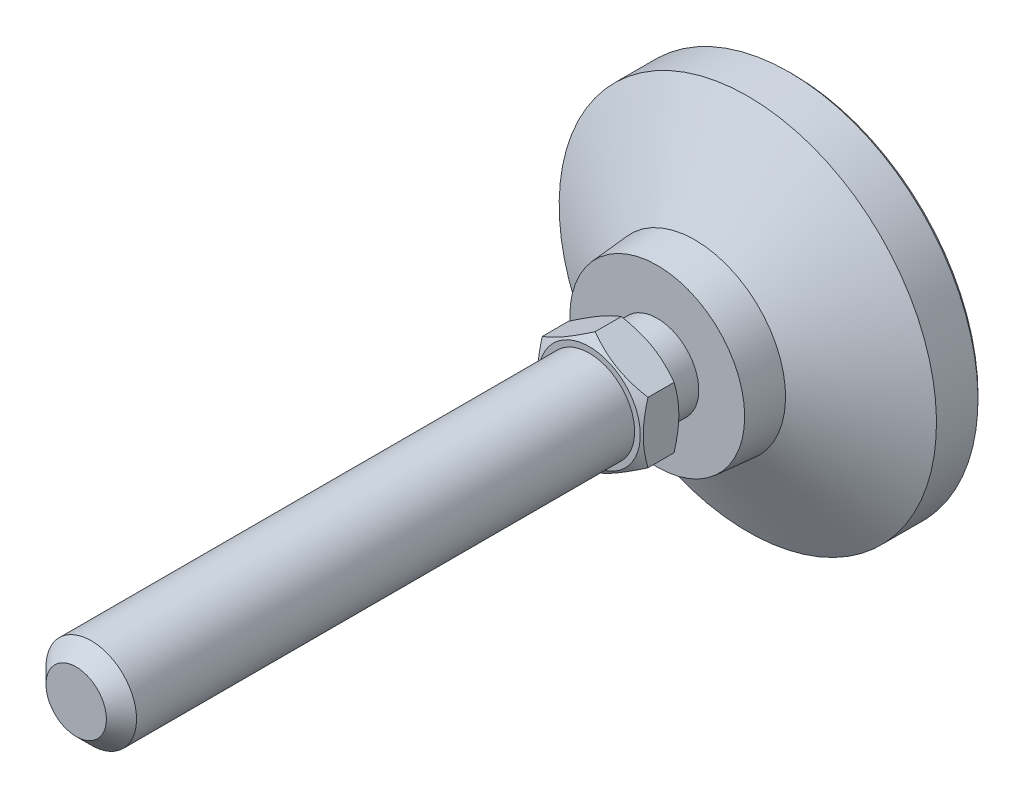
ISO-10303-21;
HEADER;
FILE_DESCRIPTION(('STEP AP214'),'2;1');
FILE_NAME('part.step','',(''),(''),'','','');
FILE_SCHEMA(('AUTOMOTIVE_DESIGN { 1 0 10303 214 1 1 1 1 }'));
ENDSEC;
DATA;
#1=APPLICATION_CONTEXT('core data for automotive mechanical design processes');
#2=APPLICATION_PROTOCOL_DEFINITION('international standard','automotive_design',2000,#1);
#3=PRODUCT_CONTEXT('',#1,'mechanical');
#4=PRODUCT('Part','Part','',(#3));
#5=PRODUCT_RELATED_PRODUCT_CATEGORY('part','',(#4));
#6=PRODUCT_DEFINITION_FORMATION('','',#4);
#7=PRODUCT_DEFINITION_CONTEXT('part definition',#1,'design');
#8=PRODUCT_DEFINITION('design','',#6,#7);
#9=PRODUCT_DEFINITION_SHAPE('','',#8);
#10=(LENGTH_UNIT() NAMED_UNIT(*) SI_UNIT(.MILLI.,.METRE.));
#11=(NAMED_UNIT(*) PLANE_ANGLE_UNIT() SI_UNIT($,.RADIAN.));
#12=(NAMED_UNIT(*) SI_UNIT($,.STERADIAN.) SOLID_ANGLE_UNIT());
#13=UNCERTAINTY_MEASURE_WITH_UNIT(LENGTH_MEASURE(1.E-05),#10,'distance_accuracy_value','');
#14=(GEOMETRIC_REPRESENTATION_CONTEXT(3) GLOBAL_UNCERTAINTY_ASSIGNED_CONTEXT((#13)) GLOBAL_UNIT_ASSIGNED_CONTEXT((#10,
#11,#12)) REPRESENTATION_CONTEXT('',''));
#15=CARTESIAN_POINT('',(0.,0.,0.));
#16=DIRECTION('',(0.,0.,1.));
#17=DIRECTION('',(1.,0.,0.));
#18=AXIS2_PLACEMENT_3D('',#15,#16,#17);
#19=CARTESIAN_POINT('',(0.,0.,-1.00000000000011));
#20=DIRECTION('',(0.,0.,-1.));
#21=DIRECTION('',(0.,1.,0.));
#22=AXIS2_PLACEMENT_3D('',#19,#20,#21);
#23=CYLINDRICAL_SURFACE('',#22,5.5);
#24=CARTESIAN_POINT('',(0.,0.,21.9999999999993));
#25=DIRECTION('',(0.,0.,-1.));
#26=DIRECTION('',(0.,1.,0.));
#27=AXIS2_PLACEMENT_3D('',#24,#25,#26);
#28=CIRCLE('',#27,5.5);
#29=CARTESIAN_POINT('',(0.,5.5,21.9999999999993));
#30=VERTEX_POINT('',#29);
#31=EDGE_CURVE('E100',#30,#30,#28,.T.);
#32=ORIENTED_EDGE('',*,*,#31,.T.);
#33=EDGE_LOOP('',(#32));
#34=FACE_BOUND('',#33,.T.);
#35=CARTESIAN_POINT('',(0.,0.,18.));
#36=DIRECTION('',(0.,0.,-1.));
#37=DIRECTION('',(0.,1.,0.));
#38=AXIS2_PLACEMENT_3D('',#35,#36,#37);
#39=CIRCLE('',#38,5.5);
#40=CARTESIAN_POINT('',(0.,5.5,18.));
#41=VERTEX_POINT('',#40);
#42=EDGE_CURVE('E93',#41,#41,#39,.T.);
#43=ORIENTED_EDGE('',*,*,#42,.F.);
#44=EDGE_LOOP('',(#43));
#45=FACE_BOUND('',#44,.T.);
#46=ADVANCED_FACE('F14',(#34,#45),#23,.T.);
#47=CARTESIAN_POINT('',(-5.5,0.,21.9999999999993));
#48=DIRECTION('',(0.,0.,1.));
#49=DIRECTION('',(0.,-1.,0.));
#50=AXIS2_PLACEMENT_3D('',#47,#48,#49);
#51=PLANE('',#50);
#52=CARTESIAN_POINT('',(0.,0.,21.9999999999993));
#53=DIRECTION('',(0.,0.,1.));
#54=DIRECTION('',(0.,-1.,0.));
#55=AXIS2_PLACEMENT_3D('',#52,#53,#54);
#56=CIRCLE('',#55,6.75);
#57=CARTESIAN_POINT('',(0.,-6.75,21.9999999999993));
#58=VERTEX_POINT('',#57);
#59=EDGE_CURVE('E417',#58,#58,#56,.T.);
#60=ORIENTED_EDGE('',*,*,#59,.F.);
#61=EDGE_LOOP('',(#60));
#62=FACE_BOUND('',#61,.T.);
#63=ORIENTED_EDGE('',*,*,#31,.F.);
#64=EDGE_LOOP('',(#63));
#65=FACE_BOUND('',#64,.T.);
#66=ADVANCED_FACE('F133',(#62,#65),#51,.F.);
#67=CARTESIAN_POINT('',(0.,-5.5,18.));
#68=DIRECTION('',(0.,0.,1.));
#69=DIRECTION('',(0.,-1.,0.));
#70=AXIS2_PLACEMENT_3D('',#67,#68,#69);
#71=PLANE('',#70);
#72=ORIENTED_EDGE('',*,*,#42,.T.);
#73=EDGE_LOOP('',(#72));
#74=FACE_BOUND('',#73,.T.);
#75=CARTESIAN_POINT('',(0.,0.,18.));
#76=DIRECTION('',(0.,0.,1.));
#77=DIRECTION('',(0.,-1.,0.));
#78=AXIS2_PLACEMENT_3D('',#75,#76,#77);
#79=CIRCLE('',#78,11.5833333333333);
#80=CARTESIAN_POINT('',(0.,-11.5833333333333,18.));
#81=VERTEX_POINT('',#80);
#82=EDGE_CURVE('E88',#81,#81,#79,.T.);
#83=ORIENTED_EDGE('',*,*,#82,.T.);
#84=EDGE_LOOP('',(#83));
#85=FACE_BOUND('',#84,.T.);
#86=ADVANCED_FACE('F124',(#74,#85),#71,.T.);
#87=CARTESIAN_POINT('',(0.,0.,0.));
#88=DIRECTION('',(0.,0.,-1.));
#89=DIRECTION('',(0.,1.,0.));
#90=AXIS2_PLACEMENT_3D('',#87,#88,#89);
#91=PLANE('',#90);
#92=CARTESIAN_POINT('',(0.,0.,0.));
#93=DIRECTION('',(0.,0.,-1.));
#94=DIRECTION('',(0.,1.,0.));
#95=AXIS2_PLACEMENT_3D('',#92,#93,#94);
#96=CIRCLE('',#95,24.5);
#97=CARTESIAN_POINT('',(0.,24.5,0.));
#98=VERTEX_POINT('',#97);
#99=EDGE_CURVE('E108',#98,#98,#96,.T.);
#100=ORIENTED_EDGE('',*,*,#99,.T.);
#101=EDGE_LOOP('',(#100));
#102=FACE_BOUND('',#101,.T.);
#103=ADVANCED_FACE('F122',(#102),#91,.T.);
#104=CARTESIAN_POINT('',(0.,0.,-1.00000000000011));
#105=DIRECTION('',(0.,0.,-1.));
#106=DIRECTION('',(0.,1.,0.));
#107=AXIS2_PLACEMENT_3D('',#104,#105,#106);
#108=CYLINDRICAL_SURFACE('',#107,25.);
#109=CARTESIAN_POINT('',(0.,0.,0.500000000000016));
#110=DIRECTION('',(0.,0.,-1.));
#111=DIRECTION('',(0.,1.,0.));
#112=AXIS2_PLACEMENT_3D('',#109,#110,#111);
#113=CIRCLE('',#112,25.);
#114=CARTESIAN_POINT('',(0.,25.,0.500000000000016));
#115=VERTEX_POINT('',#114);
#116=EDGE_CURVE('E28',#115,#115,#113,.F.);
#117=ORIENTED_EDGE('',*,*,#116,.T.);
#118=EDGE_LOOP('',(#117));
#119=FACE_BOUND('',#118,.T.);
#120=CARTESIAN_POINT('',(0.,0.,6.));
#121=DIRECTION('',(0.,0.,-1.));
#122=DIRECTION('',(0.,1.,0.));
#123=AXIS2_PLACEMENT_3D('',#120,#121,#122);
#124=CIRCLE('',#123,25.);
#125=CARTESIAN_POINT('',(0.,25.,6.));
#126=VERTEX_POINT('',#125);
#127=EDGE_CURVE('E106',#126,#126,#124,.T.);
#128=ORIENTED_EDGE('',*,*,#127,.T.);
#129=EDGE_LOOP('',(#128));
#130=FACE_BOUND('',#129,.T.);
#131=ADVANCED_FACE('F114',(#119,#130),#108,.T.);
#132=CARTESIAN_POINT('',(0.,0.,13.));
#133=DIRECTION('',(0.,0.,-1.));
#134=DIRECTION('',(0.,1.,0.));
#135=AXIS2_PLACEMENT_3D('',#132,#133,#134);
#136=CONICAL_SURFACE('',#135,11.9999999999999,1.07685495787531);
#137=ORIENTED_EDGE('',*,*,#127,.F.);
#138=EDGE_LOOP('',(#137));
#139=FACE_BOUND('',#138,.T.);
#140=CARTESIAN_POINT('',(0.,0.,13.));
#141=DIRECTION('',(0.,0.,-1.));
#142=DIRECTION('',(0.,1.,0.));
#143=AXIS2_PLACEMENT_3D('',#140,#141,#142);
#144=CIRCLE('',#143,11.9999999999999);
#145=CARTESIAN_POINT('',(0.,11.9999999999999,13.));
#146=VERTEX_POINT('',#145);
#147=EDGE_CURVE('E103',#146,#146,#144,.T.);
#148=ORIENTED_EDGE('',*,*,#147,.T.);
#149=EDGE_LOOP('',(#148));
#150=FACE_BOUND('',#149,.T.);
#151=ADVANCED_FACE('F132',(#139,#150),#136,.T.);
#152=CARTESIAN_POINT('',(0.,0.,19.));
#153=DIRECTION('',(0.,0.,-1.));
#154=DIRECTION('',(0.,1.,0.));
#155=AXIS2_PLACEMENT_3D('',#152,#153,#154);
#156=CONICAL_SURFACE('',#155,11.5,0.0831412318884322);
#157=ORIENTED_EDGE('',*,*,#147,.F.);
#158=EDGE_LOOP('',(#157));
#159=FACE_BOUND('',#158,.T.);
#160=ORIENTED_EDGE('',*,*,#82,.F.);
#161=EDGE_LOOP('',(#160));
#162=FACE_BOUND('',#161,.T.);
#163=ADVANCED_FACE('F119',(#159,#162),#156,.T.);
#164=CARTESIAN_POINT('',(0.,0.,0.));
#165=DIRECTION('',(0.,0.,1.));
#166=DIRECTION('',(0.,-1.,0.));
#167=AXIS2_PLACEMENT_3D('',#164,#165,#166);
#168=CONICAL_SURFACE('',#167,24.5,0.785398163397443);
#169=ORIENTED_EDGE('',*,*,#116,.F.);
#170=EDGE_LOOP('',(#169));
#171=FACE_BOUND('',#170,.T.);
#172=ORIENTED_EDGE('',*,*,#99,.F.);
#173=EDGE_LOOP('',(#172));
#174=FACE_BOUND('',#173,.T.);
#175=ADVANCED_FACE('F16',(#171,#174),#168,.T.);
#176=CARTESIAN_POINT('',(0.,0.,21.9999999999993));
#177=DIRECTION('',(0.,0.,1.));
#178=DIRECTION('',(0.,-1.,0.));
#179=AXIS2_PLACEMENT_3D('',#176,#177,#178);
#180=CONICAL_SURFACE('',#179,6.75,1.0471975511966);
#181=CARTESIAN_POINT('',(0.000200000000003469,-8.0830192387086,22.7696190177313));
#182=CARTESIAN_POINT('',(-0.15366790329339,-7.99418356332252,22.7183374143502));
#183=CARTESIAN_POINT('',(-0.30810950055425,-7.90501666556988,22.6693831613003));
#184=CARTESIAN_POINT('',(-0.618246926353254,-7.72595873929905,22.5767703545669));
#185=CARTESIAN_POINT('',(-0.773943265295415,-7.63606741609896,22.5331140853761));
#186=CARTESIAN_POINT('',(-1.24352516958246,-7.36495417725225,22.4109491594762));
#187=CARTESIAN_POINT('',(-1.5592643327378,-7.18266208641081,22.3414631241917));
#188=CARTESIAN_POINT('',(-2.03176224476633,-6.90986528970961,22.2599825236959));
#189=CARTESIAN_POINT('',(-2.18710922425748,-6.82017566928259,22.2367710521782));
#190=CARTESIAN_POINT('',(-2.49850511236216,-6.64039116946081,22.1978487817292));
#191=CARTESIAN_POINT('',(-2.65455395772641,-6.55029632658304,22.1821373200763));
#192=CARTESIAN_POINT('',(-2.96692267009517,-6.36995016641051,22.1586154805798));
#193=CARTESIAN_POINT('',(-3.12324202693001,-6.27969914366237,22.1507961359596));
#194=CARTESIAN_POINT('',(-3.43601650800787,-6.09911871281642,22.1432178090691));
#195=CARTESIAN_POINT('',(-3.59247162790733,-6.00878930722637,22.1434585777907));
#196=CARTESIAN_POINT('',(-4.02110687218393,-5.76131663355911,22.1551972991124));
#197=CARTESIAN_POINT('',(-4.2931466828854,-5.60425437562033,22.1749033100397));
#198=CARTESIAN_POINT('',(-4.8354194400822,-5.29117305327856,22.2373910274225));
#199=CARTESIAN_POINT('',(-5.10565047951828,-5.13515508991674,22.2801940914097));
#200=CARTESIAN_POINT('',(-5.64901454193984,-4.82144370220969,22.3871892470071));
#201=CARTESIAN_POINT('',(-5.92207900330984,-4.6637898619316,22.4518346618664));
#202=CARTESIAN_POINT('',(-6.46413578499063,-4.35083323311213,22.5985536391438));
#203=CARTESIAN_POINT('',(-6.73313504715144,-4.19552643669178,22.6805927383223));
#204=CARTESIAN_POINT('',(-7.0002,-4.04133641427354,22.7696190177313));
#205=B_SPLINE_CURVE_WITH_KNOTS('',3,(#181,#182,#183,#184,#185,#186,#187,#188,#189,#190,#191,
#192,#193,#194,#195,#196,#197,#198,#199,#200,#201,#202,#203,#204),.UNSPECIFIED.,.F.,.F.,(4,2,2,
2,2,2,2,2,2,2,2,4),(0.,0.554727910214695,1.10969417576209,2.2219327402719,2.76443041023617,
3.30688013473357,3.8487128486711,4.39052882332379,5.33376515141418,6.27787517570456,
7.2429241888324,8.20607866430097),.UNSPECIFIED.);
#206=CARTESIAN_POINT('',(0.,-8.08290376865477,22.769552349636));
#207=VERTEX_POINT('',#206);
#208=CARTESIAN_POINT('',(-7.,-4.04145188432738,22.769552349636));
#209=VERTEX_POINT('',#208);
#210=EDGE_CURVE('E73',#207,#209,#205,.T.);
#211=ORIENTED_EDGE('',*,*,#210,.T.);
#212=CARTESIAN_POINT('',(-7.,10.836280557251,25.5510392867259));
#213=CARTESIAN_POINT('',(-7.,10.5307071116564,25.4028875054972));
#214=CARTESIAN_POINT('',(-7.,10.2244300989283,25.2561619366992));
#215=CARTESIAN_POINT('',(-7.,9.61009469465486,24.966365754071));
#216=CARTESIAN_POINT('',(-7.,9.30203602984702,24.8232957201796));
#217=CARTESIAN_POINT('',(-7.,8.68216648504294,24.5408891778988));
#218=CARTESIAN_POINT('',(-7.,8.37034429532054,24.4015774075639));
#219=CARTESIAN_POINT('',(-7.,7.74421297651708,24.1286811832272));
#220=CARTESIAN_POINT('',(-7.,7.4299039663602,23.9950964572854));
#221=CARTESIAN_POINT('',(-7.,6.78823093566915,23.7310236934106));
#222=CARTESIAN_POINT('',(-7.,6.46076999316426,23.6007698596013));
#223=CARTESIAN_POINT('',(-7.,5.80201061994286,23.3501676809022));
#224=CARTESIAN_POINT('',(-7.,5.47071176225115,23.2298204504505));
#225=CARTESIAN_POINT('',(-7.,4.80437190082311,23.0022055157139));
#226=CARTESIAN_POINT('',(-7.,4.46934009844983,22.894911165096));
#227=CARTESIAN_POINT('',(-7.,3.79448284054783,22.6968563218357));
#228=CARTESIAN_POINT('',(-7.,3.45465893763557,22.6060906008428));
#229=CARTESIAN_POINT('',(-7.,2.77184947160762,22.4459493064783));
#230=CARTESIAN_POINT('',(-7.,2.42889167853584,22.3764585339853));
#231=CARTESIAN_POINT('',(-7.,1.9113475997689,22.2911970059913));
#232=CARTESIAN_POINT('',(-7.,1.73830215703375,22.2659377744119));
#233=CARTESIAN_POINT('',(-7.,1.39135780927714,22.2222400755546));
#234=CARTESIAN_POINT('',(-7.,1.21745898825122,22.2038009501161));
#235=CARTESIAN_POINT('',(-7.,0.871304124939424,22.174341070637));
#236=CARTESIAN_POINT('',(-7.,0.699056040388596,22.1632271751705));
#237=CARTESIAN_POINT('',(-7.,0.354244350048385,22.1482919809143));
#238=CARTESIAN_POINT('',(-7.,0.181680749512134,22.1444705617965));
#239=CARTESIAN_POINT('',(-7.,-0.163453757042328,22.1442114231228));
#240=CARTESIAN_POINT('',(-7.,-0.336024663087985,22.1477737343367));
#241=CARTESIAN_POINT('',(-7.,-0.680863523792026,22.1621953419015));
#242=CARTESIAN_POINT('',(-7.,-0.853131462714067,22.1730550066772));
#243=CARTESIAN_POINT('',(-7.,-1.26773646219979,22.2077439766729));
#244=CARTESIAN_POINT('',(-7.,-1.50978718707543,22.2350685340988));
#245=CARTESIAN_POINT('',(-7.,-1.99206790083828,22.3026291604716));
#246=CARTESIAN_POINT('',(-7.,-2.2322976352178,22.3428670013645));
#247=CARTESIAN_POINT('',(-7.,-2.94999422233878,22.4808147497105));
#248=CARTESIAN_POINT('',(-7.,-3.4241958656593,22.5957330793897));
#249=CARTESIAN_POINT('',(-7.,-4.13323026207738,22.794709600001));
#250=CARTESIAN_POINT('',(-7.,-4.37174830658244,22.8663882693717));
#251=CARTESIAN_POINT('',(-7.,-4.846467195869,23.0171152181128));
#252=CARTESIAN_POINT('',(-7.,-5.0826680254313,23.0961635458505));
#253=CARTESIAN_POINT('',(-7.,-5.55282825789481,23.2603677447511));
#254=CARTESIAN_POINT('',(-7.,-5.78678838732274,23.3455215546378));
#255=CARTESIAN_POINT('',(-7.,-6.25277524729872,23.5209422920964));
#256=CARTESIAN_POINT('',(-7.,-6.48480199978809,23.6112091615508));
#257=CARTESIAN_POINT('',(-7.,-7.02953823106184,23.8289412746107));
#258=CARTESIAN_POINT('',(-7.,-7.34153026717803,23.9581980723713));
#259=CARTESIAN_POINT('',(-7.,-7.96288686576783,24.2228976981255));
#260=CARTESIAN_POINT('',(-7.,-8.27225127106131,24.3583408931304));
#261=CARTESIAN_POINT('',(-7.,-8.8888322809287,24.6341786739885));
#262=CARTESIAN_POINT('',(-7.,-9.19604844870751,24.7745742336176));
#263=CARTESIAN_POINT('',(-7.,-9.80864017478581,25.0593321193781));
#264=CARTESIAN_POINT('',(-7.,-10.1140156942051,25.2036945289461));
#265=CARTESIAN_POINT('',(-7.,-10.723539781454,25.4957963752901));
#266=CARTESIAN_POINT('',(-7.,-11.0276867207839,25.6435392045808));
#267=CARTESIAN_POINT('',(-7.,-11.6346754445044,25.9416844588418));
#268=CARTESIAN_POINT('',(-7.,-11.9375172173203,26.0920869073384));
#269=CARTESIAN_POINT('',(-7.,-12.8443159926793,26.5465408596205));
#270=CARTESIAN_POINT('',(-7.,-13.4466263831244,26.8538775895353));
#271=CARTESIAN_POINT('',(-7.,-14.5981078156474,27.4489151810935));
#272=CARTESIAN_POINT('',(-7.,-15.1475340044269,27.7361244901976));
#273=CARTESIAN_POINT('',(-7.,-16.2443432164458,28.3144611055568));
#274=CARTESIAN_POINT('',(-7.,-16.7917261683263,28.6055885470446));
#275=CARTESIAN_POINT('',(-7.,-17.8835539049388,29.1901114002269));
#276=CARTESIAN_POINT('',(-7.,-18.4280026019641,29.4834995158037));
#277=CARTESIAN_POINT('',(-7.,-19.5155921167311,30.072620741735));
#278=CARTESIAN_POINT('',(-7.,-20.0587330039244,30.3683537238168));
#279=CARTESIAN_POINT('',(-7.,-20.6013917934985,30.6649627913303));
#280=B_SPLINE_CURVE_WITH_KNOTS('',3,(#212,#213,#214,#215,#216,#217,#218,#219,#220,#221,#222,
#223,#224,#225,#226,#227,#228,#229,#230,#231,#232,#233,#234,#235,#236,#237,#238,#239,#240,#241,
#242,#243,#244,#245,#246,#247,#248,#249,#250,#251,#252,#253,#254,#255,#256,#257,#258,#259,#260,
#261,#262,#263,#264,#265,#266,#267,#268,#269,#270,#271,#272,#273,#274,#275,#276,#277,#278,#279),
.UNSPECIFIED.,.F.,.F.,(4,2,2,2,2,2,2,2,2,2,2,2,2,2,2,2,2,2,2,2,2,2,2,2,2,2,2,2,2,2,2,2,2,4),(0.,
1.01879451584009,2.03774966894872,3.0622852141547,4.08677205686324,5.14389438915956,
6.20113547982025,7.25618073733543,8.31089168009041,9.35978624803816,9.88431075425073,
10.4087846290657,10.9264540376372,11.4441149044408,11.9617779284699,12.4794670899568,
13.2098184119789,13.9402699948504,15.4019909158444,16.1490962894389,16.8962065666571,
17.6430657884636,18.3899165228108,19.4029493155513,20.4160422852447,21.4293355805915,
22.4426502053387,23.4570307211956,24.471420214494,26.4999329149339,28.3598152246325,
30.2197618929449,32.0751556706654,33.9304486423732),.UNSPECIFIED.);
#281=CARTESIAN_POINT('',(-7.,4.04145188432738,22.769552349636));
#282=VERTEX_POINT('',#281);
#283=EDGE_CURVE('E81',#209,#282,#280,.F.);
#284=ORIENTED_EDGE('',*,*,#283,.T.);
#285=CARTESIAN_POINT('',(-7.0002,4.04133641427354,22.7696190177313));
#286=CARTESIAN_POINT('',(-6.84633209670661,4.13017208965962,22.7183374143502));
#287=CARTESIAN_POINT('',(-6.69189049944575,4.21933898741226,22.6693831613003));
#288=CARTESIAN_POINT('',(-6.38175307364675,4.39839691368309,22.5767703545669));
#289=CARTESIAN_POINT('',(-6.22605673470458,4.48828823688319,22.5331140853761));
#290=CARTESIAN_POINT('',(-5.75647483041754,4.75940147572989,22.4109491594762));
#291=CARTESIAN_POINT('',(-5.4407356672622,4.94169356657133,22.3414631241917));
#292=CARTESIAN_POINT('',(-4.96823775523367,5.21449036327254,22.2599825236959));
#293=CARTESIAN_POINT('',(-4.81289077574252,5.30417998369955,22.2367710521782));
#294=CARTESIAN_POINT('',(-4.50149488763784,5.48396448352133,22.1978487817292));
#295=CARTESIAN_POINT('',(-4.34544604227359,5.57405932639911,22.1821373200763));
#296=CARTESIAN_POINT('',(-4.03307732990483,5.75440548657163,22.1586154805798));
#297=CARTESIAN_POINT('',(-3.87675797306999,5.84465650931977,22.1507961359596));
#298=CARTESIAN_POINT('',(-3.56398349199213,6.02523694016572,22.1432178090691));
#299=CARTESIAN_POINT('',(-3.40752837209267,6.11556634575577,22.1434585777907));
#300=CARTESIAN_POINT('',(-2.97889312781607,6.36303901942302,22.1551972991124));
#301=CARTESIAN_POINT('',(-2.7068533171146,6.52010127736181,22.1749033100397));
#302=CARTESIAN_POINT('',(-2.16458055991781,6.83318259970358,22.2373910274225));
#303=CARTESIAN_POINT('',(-1.89434952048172,6.9892005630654,22.2801940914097));
#304=CARTESIAN_POINT('',(-1.35098545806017,7.30291195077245,22.3871892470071));
#305=CARTESIAN_POINT('',(-1.07792099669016,7.46056579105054,22.4518346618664));
#306=CARTESIAN_POINT('',(-0.535864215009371,7.77352241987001,22.5985536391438));
#307=CARTESIAN_POINT('',(-0.26686495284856,7.92882921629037,22.6805927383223));
#308=CARTESIAN_POINT('',(0.000199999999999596,8.0830192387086,22.7696190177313));
#309=B_SPLINE_CURVE_WITH_KNOTS('',3,(#285,#286,#287,#288,#289,#290,#291,#292,#293,#294,#295,
#296,#297,#298,#299,#300,#301,#302,#303,#304,#305,#306,#307,#308),.UNSPECIFIED.,.F.,.F.,(4,2,2,
2,2,2,2,2,2,2,2,4),(0.,0.554727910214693,1.10969417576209,2.2219327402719,2.76443041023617,
3.30688013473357,3.84871284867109,4.39052882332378,5.33376515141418,6.27787517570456,
7.2429241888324,8.20607866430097),.UNSPECIFIED.);
#310=CARTESIAN_POINT('',(0.,8.08290376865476,22.769552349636));
#311=VERTEX_POINT('',#310);
#312=EDGE_CURVE('E361',#282,#311,#309,.T.);
#313=ORIENTED_EDGE('',*,*,#312,.T.);
#314=CARTESIAN_POINT('',(-0.000200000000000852,8.0830192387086,22.7696190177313));
#315=CARTESIAN_POINT('',(0.15366790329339,7.99418356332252,22.7183374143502));
#316=CARTESIAN_POINT('',(0.308109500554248,7.90501666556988,22.6693831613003));
#317=CARTESIAN_POINT('',(0.618246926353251,7.72595873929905,22.5767703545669));
#318=CARTESIAN_POINT('',(0.773943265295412,7.63606741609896,22.5331140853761));
#319=CARTESIAN_POINT('',(1.24352516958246,7.36495417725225,22.4109491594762));
#320=CARTESIAN_POINT('',(1.5592643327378,7.18266208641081,22.3414631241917));
#321=CARTESIAN_POINT('',(2.03176224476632,6.9098652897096,22.2599825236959));
#322=CARTESIAN_POINT('',(2.18710922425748,6.82017566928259,22.2367710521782));
#323=CARTESIAN_POINT('',(2.49850511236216,6.64039116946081,22.1978487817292));
#324=CARTESIAN_POINT('',(2.6545539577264,6.55029632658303,22.1821373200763));
#325=CARTESIAN_POINT('',(2.96692267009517,6.36995016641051,22.1586154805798));
#326=CARTESIAN_POINT('',(3.12324202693,6.27969914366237,22.1507961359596));
#327=CARTESIAN_POINT('',(3.43601650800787,6.09911871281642,22.1432178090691));
#328=CARTESIAN_POINT('',(3.59247162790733,6.00878930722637,22.1434585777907));
#329=CARTESIAN_POINT('',(4.02110687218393,5.76131663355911,22.1551972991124));
#330=CARTESIAN_POINT('',(4.29314668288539,5.60425437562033,22.1749033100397));
#331=CARTESIAN_POINT('',(4.83541944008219,5.29117305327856,22.2373910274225));
#332=CARTESIAN_POINT('',(5.10565047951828,5.13515508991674,22.2801940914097));
#333=CARTESIAN_POINT('',(5.64901454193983,4.82144370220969,22.3871892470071));
#334=CARTESIAN_POINT('',(5.92207900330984,4.66378986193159,22.4518346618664));
#335=CARTESIAN_POINT('',(6.46413578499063,4.35083323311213,22.5985536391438));
#336=CARTESIAN_POINT('',(6.73313504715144,4.19552643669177,22.6805927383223));
#337=CARTESIAN_POINT('',(7.0002,4.04133641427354,22.7696190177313));
#338=B_SPLINE_CURVE_WITH_KNOTS('',3,(#314,#315,#316,#317,#318,#319,#320,#321,#322,#323,#324,
#325,#326,#327,#328,#329,#330,#331,#332,#333,#334,#335,#336,#337),.UNSPECIFIED.,.F.,.F.,(4,2,2,
2,2,2,2,2,2,2,2,4),(0.,0.554727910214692,1.10969417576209,2.2219327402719,2.76443041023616,
3.30688013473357,3.84871284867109,4.39052882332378,5.33376515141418,6.27787517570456,
7.2429241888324,8.20607866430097),.UNSPECIFIED.);
#339=CARTESIAN_POINT('',(7.,4.04145188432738,22.769552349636));
#340=VERTEX_POINT('',#339);
#341=EDGE_CURVE('E356',#311,#340,#338,.T.);
#342=ORIENTED_EDGE('',*,*,#341,.T.);
#343=CARTESIAN_POINT('',(7.,10.836280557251,25.5510392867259));
#344=CARTESIAN_POINT('',(7.,10.5307071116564,25.4028875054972));
#345=CARTESIAN_POINT('',(7.,10.2244300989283,25.2561619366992));
#346=CARTESIAN_POINT('',(7.,9.61009469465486,24.966365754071));
#347=CARTESIAN_POINT('',(7.,9.30203602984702,24.8232957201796));
#348=CARTESIAN_POINT('',(7.,8.68216648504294,24.5408891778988));
#349=CARTESIAN_POINT('',(7.,8.37034429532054,24.4015774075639));
#350=CARTESIAN_POINT('',(7.,7.74421297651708,24.1286811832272));
#351=CARTESIAN_POINT('',(7.,7.4299039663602,23.9950964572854));
#352=CARTESIAN_POINT('',(7.,6.78823093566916,23.7310236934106));
#353=CARTESIAN_POINT('',(7.,6.46076999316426,23.6007698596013));
#354=CARTESIAN_POINT('',(7.,5.80201061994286,23.3501676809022));
#355=CARTESIAN_POINT('',(7.,5.47071176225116,23.2298204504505));
#356=CARTESIAN_POINT('',(7.,4.80437190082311,23.0022055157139));
#357=CARTESIAN_POINT('',(7.,4.46934009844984,22.894911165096));
#358=CARTESIAN_POINT('',(7.,3.79448284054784,22.6968563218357));
#359=CARTESIAN_POINT('',(7.,3.45465893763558,22.6060906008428));
#360=CARTESIAN_POINT('',(7.,2.77184947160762,22.4459493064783));
#361=CARTESIAN_POINT('',(7.,2.42889167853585,22.3764585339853));
#362=CARTESIAN_POINT('',(7.,1.91134759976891,22.2911970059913));
#363=CARTESIAN_POINT('',(7.,1.73830215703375,22.2659377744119));
#364=CARTESIAN_POINT('',(7.,1.39135780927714,22.2222400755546));
#365=CARTESIAN_POINT('',(7.,1.21745898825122,22.2038009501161));
#366=CARTESIAN_POINT('',(7.,0.871304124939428,22.174341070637));
#367=CARTESIAN_POINT('',(7.,0.6990560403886,22.1632271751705));
#368=CARTESIAN_POINT('',(7.,0.354244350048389,22.1482919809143));
#369=CARTESIAN_POINT('',(7.,0.181680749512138,22.1444705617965));
#370=CARTESIAN_POINT('',(7.,-0.163453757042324,22.1442114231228));
#371=CARTESIAN_POINT('',(7.,-0.336024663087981,22.1477737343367));
#372=CARTESIAN_POINT('',(7.,-0.680863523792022,22.1621953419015));
#373=CARTESIAN_POINT('',(7.,-0.853131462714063,22.1730550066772));
#374=CARTESIAN_POINT('',(7.,-1.26773646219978,22.2077439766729));
#375=CARTESIAN_POINT('',(7.,-1.50978718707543,22.2350685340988));
#376=CARTESIAN_POINT('',(7.,-1.99206790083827,22.3026291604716));
#377=CARTESIAN_POINT('',(7.,-2.2322976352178,22.3428670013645));
#378=CARTESIAN_POINT('',(7.,-2.94999422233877,22.4808147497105));
#379=CARTESIAN_POINT('',(7.,-3.4241958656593,22.5957330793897));
#380=CARTESIAN_POINT('',(7.,-4.13323026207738,22.794709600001));
#381=CARTESIAN_POINT('',(7.,-4.37174830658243,22.8663882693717));
#382=CARTESIAN_POINT('',(7.,-4.84646719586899,23.0171152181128));
#383=CARTESIAN_POINT('',(7.,-5.08266802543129,23.0961635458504));
#384=CARTESIAN_POINT('',(7.,-5.5528282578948,23.2603677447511));
#385=CARTESIAN_POINT('',(7.,-5.78678838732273,23.3455215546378));
#386=CARTESIAN_POINT('',(7.,-6.25277524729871,23.5209422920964));
#387=CARTESIAN_POINT('',(7.,-6.48480199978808,23.6112091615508));
#388=CARTESIAN_POINT('',(7.,-7.02953823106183,23.8289412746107));
#389=CARTESIAN_POINT('',(7.,-7.34153026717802,23.9581980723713));
#390=CARTESIAN_POINT('',(7.,-7.96288686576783,24.2228976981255));
#391=CARTESIAN_POINT('',(7.,-8.2722512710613,24.3583408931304));
#392=CARTESIAN_POINT('',(7.,-8.88883228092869,24.6341786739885));
#393=CARTESIAN_POINT('',(7.,-9.19604844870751,24.7745742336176));
#394=CARTESIAN_POINT('',(7.,-9.8086401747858,25.0593321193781));
#395=CARTESIAN_POINT('',(7.,-10.1140156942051,25.2036945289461));
#396=CARTESIAN_POINT('',(7.,-10.723539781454,25.4957963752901));
#397=CARTESIAN_POINT('',(7.,-11.0276867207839,25.6435392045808));
#398=CARTESIAN_POINT('',(7.,-11.6346754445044,25.9416844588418));
#399=CARTESIAN_POINT('',(7.,-11.9375172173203,26.0920869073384));
#400=CARTESIAN_POINT('',(7.,-12.8443159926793,26.5465408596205));
#401=CARTESIAN_POINT('',(7.,-13.4466263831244,26.8538775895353));
#402=CARTESIAN_POINT('',(7.,-14.5981078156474,27.4489151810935));
#403=CARTESIAN_POINT('',(7.,-15.1475340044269,27.7361244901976));
#404=CARTESIAN_POINT('',(7.,-16.2443432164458,28.3144611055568));
#405=CARTESIAN_POINT('',(7.,-16.7917261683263,28.6055885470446));
#406=CARTESIAN_POINT('',(7.,-17.8835539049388,29.1901114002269));
#407=CARTESIAN_POINT('',(7.,-18.4280026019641,29.4834995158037));
#408=CARTESIAN_POINT('',(7.,-19.5155921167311,30.072620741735));
#409=CARTESIAN_POINT('',(7.,-20.0587330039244,30.3683537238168));
#410=CARTESIAN_POINT('',(7.,-20.6013917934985,30.6649627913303));
#411=B_SPLINE_CURVE_WITH_KNOTS('',3,(#343,#344,#345,#346,#347,#348,#349,#350,#351,#352,#353,
#354,#355,#356,#357,#358,#359,#360,#361,#362,#363,#364,#365,#366,#367,#368,#369,#370,#371,#372,
#373,#374,#375,#376,#377,#378,#379,#380,#381,#382,#383,#384,#385,#386,#387,#388,#389,#390,#391,
#392,#393,#394,#395,#396,#397,#398,#399,#400,#401,#402,#403,#404,#405,#406,#407,#408,#409,#410),
.UNSPECIFIED.,.F.,.F.,(4,2,2,2,2,2,2,2,2,2,2,2,2,2,2,2,2,2,2,2,2,2,2,2,2,2,2,2,2,2,2,2,2,4),(0.,
1.01879451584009,2.03774966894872,3.06228521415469,4.08677205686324,5.14389438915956,
6.20113547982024,7.25618073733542,8.31089168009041,9.35978624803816,9.88431075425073,
10.4087846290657,10.9264540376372,11.4441149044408,11.9617779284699,12.4794670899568,
13.2098184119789,13.9402699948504,15.4019909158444,16.1490962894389,16.8962065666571,
17.6430657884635,18.3899165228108,19.4029493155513,20.4160422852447,21.4293355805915,
22.4426502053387,23.4570307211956,24.471420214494,26.4999329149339,28.3598152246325,
30.2197618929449,32.0751556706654,33.9304486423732),.UNSPECIFIED.);
#412=CARTESIAN_POINT('',(7.,-4.04145188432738,22.769552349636));
#413=VERTEX_POINT('',#412);
#414=EDGE_CURVE('E34',#340,#413,#411,.T.);
#415=ORIENTED_EDGE('',*,*,#414,.T.);
#416=CARTESIAN_POINT('',(7.0002,-4.04133641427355,22.7696190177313));
#417=CARTESIAN_POINT('',(6.84633209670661,-4.13017208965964,22.7183374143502));
#418=CARTESIAN_POINT('',(6.69189049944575,-4.21933898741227,22.6693831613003));
#419=CARTESIAN_POINT('',(6.38175307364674,-4.3983969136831,22.5767703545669));
#420=CARTESIAN_POINT('',(6.22605673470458,-4.4882882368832,22.5331140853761));
#421=CARTESIAN_POINT('',(5.75647483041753,-4.7594014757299,22.4109491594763));
#422=CARTESIAN_POINT('',(5.4407356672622,-4.94169356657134,22.3414631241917));
#423=CARTESIAN_POINT('',(4.96823775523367,-5.21449036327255,22.2599825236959));
#424=CARTESIAN_POINT('',(4.81289077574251,-5.30417998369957,22.2367710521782));
#425=CARTESIAN_POINT('',(4.50149488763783,-5.48396448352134,22.1978487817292));
#426=CARTESIAN_POINT('',(4.34544604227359,-5.57405932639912,22.1821373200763));
#427=CARTESIAN_POINT('',(4.03307732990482,-5.75440548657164,22.1586154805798));
#428=CARTESIAN_POINT('',(3.87675797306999,-5.84465650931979,22.1507961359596));
#429=CARTESIAN_POINT('',(3.56398349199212,-6.02523694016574,22.1432178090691));
#430=CARTESIAN_POINT('',(3.40752837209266,-6.11556634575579,22.1434585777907));
#431=CARTESIAN_POINT('',(2.97889312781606,-6.36303901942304,22.1551972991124));
#432=CARTESIAN_POINT('',(2.7068533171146,-6.52010127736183,22.1749033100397));
#433=CARTESIAN_POINT('',(2.1645805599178,-6.8331825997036,22.2373910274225));
#434=CARTESIAN_POINT('',(1.89434952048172,-6.98920056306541,22.2801940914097));
#435=CARTESIAN_POINT('',(1.35098545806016,-7.30291195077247,22.3871892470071));
#436=CARTESIAN_POINT('',(1.07792099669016,-7.46056579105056,22.4518346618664));
#437=CARTESIAN_POINT('',(0.535864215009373,-7.77352241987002,22.5985536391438));
#438=CARTESIAN_POINT('',(0.266864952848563,-7.92882921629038,22.6805927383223));
#439=CARTESIAN_POINT('',(-0.00019999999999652,-8.08301923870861,22.7696190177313));
#440=B_SPLINE_CURVE_WITH_KNOTS('',3,(#416,#417,#418,#419,#420,#421,#422,#423,#424,#425,#426,
#427,#428,#429,#430,#431,#432,#433,#434,#435,#436,#437,#438,#439),.UNSPECIFIED.,.F.,.F.,(4,2,2,
2,2,2,2,2,2,2,2,4),(0.,0.554727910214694,1.10969417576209,2.2219327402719,2.76443041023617,
3.30688013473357,3.8487128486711,4.39052882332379,5.33376515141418,6.27787517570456,
7.24292418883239,8.20607866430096),.UNSPECIFIED.);
#441=EDGE_CURVE('E9',#413,#207,#440,.T.);
#442=ORIENTED_EDGE('',*,*,#441,.T.);
#443=EDGE_LOOP('',(#211,#284,#313,#342,#415,#442));
#444=FACE_BOUND('',#443,.T.);
#445=ORIENTED_EDGE('',*,*,#59,.T.);
#446=EDGE_LOOP('',(#445));
#447=FACE_BOUND('',#446,.T.);
#448=ADVANCED_FACE('F71',(#444,#447),#180,.T.);
#449=CARTESIAN_POINT('',(0.,0.,95.));
#450=DIRECTION('',(0.,0.,-1.));
#451=DIRECTION('',(0.,1.,0.));
#452=AXIS2_PLACEMENT_3D('',#449,#450,#451);
#453=PLANE('',#452);
#454=CARTESIAN_POINT('',(0.,0.,95.));
#455=DIRECTION('',(0.,0.,-1.));
#456=DIRECTION('',(0.,1.,0.));
#457=AXIS2_PLACEMENT_3D('',#454,#455,#456);
#458=CIRCLE('',#457,3.99999999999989);
#459=CARTESIAN_POINT('',(0.,3.99999999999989,95.));
#460=VERTEX_POINT('',#459);
#461=EDGE_CURVE('E393',#460,#460,#458,.T.);
#462=ORIENTED_EDGE('',*,*,#461,.F.);
#463=EDGE_LOOP('',(#462));
#464=FACE_BOUND('',#463,.T.);
#465=ADVANCED_FACE('F187',(#464),#453,.F.);
#466=CARTESIAN_POINT('',(0.,0.,95.));
#467=DIRECTION('',(0.,0.,-1.));
#468=DIRECTION('',(0.,1.,0.));
#469=AXIS2_PLACEMENT_3D('',#466,#467,#468);
#470=CONICAL_SURFACE('',#469,3.99999999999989,0.785398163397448);
#471=CARTESIAN_POINT('',(0.,0.,93.));
#472=DIRECTION('',(0.,0.,-1.));
#473=DIRECTION('',(0.,1.,0.));
#474=AXIS2_PLACEMENT_3D('',#471,#472,#473);
#475=CIRCLE('',#474,5.99999999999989);
#476=CARTESIAN_POINT('',(0.,5.99999999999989,93.));
#477=VERTEX_POINT('',#476);
#478=EDGE_CURVE('E391',#477,#477,#475,.T.);
#479=ORIENTED_EDGE('',*,*,#478,.F.);
#480=EDGE_LOOP('',(#479));
#481=FACE_BOUND('',#480,.T.);
#482=ORIENTED_EDGE('',*,*,#461,.T.);
#483=EDGE_LOOP('',(#482));
#484=FACE_BOUND('',#483,.T.);
#485=ADVANCED_FACE('F194',(#481,#484),#470,.T.);
#486=CARTESIAN_POINT('',(0.,0.,-1.00000000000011));
#487=DIRECTION('',(0.,0.,-1.));
#488=DIRECTION('',(0.,1.,0.));
#489=AXIS2_PLACEMENT_3D('',#486,#487,#488);
#490=CYLINDRICAL_SURFACE('',#489,5.99999999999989);
#491=CARTESIAN_POINT('',(0.,0.,26.9999999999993));
#492=DIRECTION('',(0.,0.,-1.));
#493=DIRECTION('',(0.,1.,0.));
#494=AXIS2_PLACEMENT_3D('',#491,#492,#493);
#495=CIRCLE('',#494,5.99999999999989);
#496=CARTESIAN_POINT('',(0.,5.99999999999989,26.9999999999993));
#497=VERTEX_POINT('',#496);
#498=EDGE_CURVE('E97',#497,#497,#495,.T.);
#499=ORIENTED_EDGE('',*,*,#498,.F.);
#500=EDGE_LOOP('',(#499));
#501=FACE_BOUND('',#500,.T.);
#502=ORIENTED_EDGE('',*,*,#478,.T.);
#503=EDGE_LOOP('',(#502));
#504=FACE_BOUND('',#503,.T.);
#505=ADVANCED_FACE('F203',(#501,#504),#490,.T.);
#506=CARTESIAN_POINT('',(-5.99999999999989,0.,26.9999999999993));
#507=DIRECTION('',(0.,0.,-1.));
#508=DIRECTION('',(0.,1.,0.));
#509=AXIS2_PLACEMENT_3D('',#506,#507,#508);
#510=PLANE('',#509);
#511=CARTESIAN_POINT('',(0.,0.,26.9999999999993));
#512=DIRECTION('',(0.,0.,1.));
#513=DIRECTION('',(0.,-1.,0.));
#514=AXIS2_PLACEMENT_3D('',#511,#512,#513);
#515=CIRCLE('',#514,6.75);
#516=CARTESIAN_POINT('',(0.,-6.75,26.9999999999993));
#517=VERTEX_POINT('',#516);
#518=EDGE_CURVE('E80',#517,#517,#515,.T.);
#519=ORIENTED_EDGE('',*,*,#518,.T.);
#520=EDGE_LOOP('',(#519));
#521=FACE_BOUND('',#520,.T.);
#522=ORIENTED_EDGE('',*,*,#498,.T.);
#523=EDGE_LOOP('',(#522));
#524=FACE_BOUND('',#523,.T.);
#525=ADVANCED_FACE('F212',(#521,#524),#510,.F.);
#526=CARTESIAN_POINT('',(0.,0.,25.2403454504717));
#527=DIRECTION('',(0.,0.,-1.));
#528=DIRECTION('',(0.,1.,0.));
#529=AXIS2_PLACEMENT_3D('',#526,#527,#528);
#530=CONICAL_SURFACE('',#529,9.79781108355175,1.0471975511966);
#531=CARTESIAN_POINT('',(-7.0002,-4.04133641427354,26.2303809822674));
#532=CARTESIAN_POINT('',(-6.84633209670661,-4.13017208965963,26.2816625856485));
#533=CARTESIAN_POINT('',(-6.69189049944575,-4.21933898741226,26.3306168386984));
#534=CARTESIAN_POINT('',(-6.38175307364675,-4.39839691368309,26.4232296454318));
#535=CARTESIAN_POINT('',(-6.22605673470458,-4.48828823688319,26.4668859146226));
#536=CARTESIAN_POINT('',(-5.75647483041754,-4.7594014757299,26.5890508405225));
#537=CARTESIAN_POINT('',(-5.4407356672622,-4.94169356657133,26.658536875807));
#538=CARTESIAN_POINT('',(-4.96823775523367,-5.21449036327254,26.7400174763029));
#539=CARTESIAN_POINT('',(-4.81289077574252,-5.30417998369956,26.7632289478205));
#540=CARTESIAN_POINT('',(-4.50149488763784,-5.48396448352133,26.8021512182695));
#541=CARTESIAN_POINT('',(-4.34544604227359,-5.57405932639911,26.8178626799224));
#542=CARTESIAN_POINT('',(-4.03307732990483,-5.75440548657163,26.8413845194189));
#543=CARTESIAN_POINT('',(-3.87675797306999,-5.84465650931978,26.8492038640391));
#544=CARTESIAN_POINT('',(-3.56398349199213,-6.02523694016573,26.8567821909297));
#545=CARTESIAN_POINT('',(-3.40752837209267,-6.11556634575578,26.856541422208));
#546=CARTESIAN_POINT('',(-2.97889312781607,-6.36303901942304,26.8448027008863));
#547=CARTESIAN_POINT('',(-2.7068533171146,-6.52010127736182,26.825096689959));
#548=CARTESIAN_POINT('',(-2.1645805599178,-6.83318259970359,26.7626089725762));
#549=CARTESIAN_POINT('',(-1.89434952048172,-6.98920056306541,26.719805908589));
#550=CARTESIAN_POINT('',(-1.35098545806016,-7.30291195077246,26.6128107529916));
#551=CARTESIAN_POINT('',(-1.07792099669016,-7.46056579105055,26.5481653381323));
#552=CARTESIAN_POINT('',(-0.535864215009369,-7.77352241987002,26.4014463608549));
#553=CARTESIAN_POINT('',(-0.266864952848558,-7.92882921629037,26.3194072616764));
#554=CARTESIAN_POINT('',(0.000200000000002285,-8.0830192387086,26.2303809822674));
#555=B_SPLINE_CURVE_WITH_KNOTS('',3,(#531,#532,#533,#534,#535,#536,#537,#538,#539,#540,#541,
#542,#543,#544,#545,#546,#547,#548,#549,#550,#551,#552,#553,#554),.UNSPECIFIED.,.F.,.F.,(4,2,2,
2,2,2,2,2,2,2,2,4),(0.,0.554727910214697,1.10969417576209,2.2219327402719,2.76443041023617,
3.30688013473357,3.8487128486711,4.39052882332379,5.33376515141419,6.27787517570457,
7.2429241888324,8.20607866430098),.UNSPECIFIED.);
#556=CARTESIAN_POINT('',(-7.,-4.04145188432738,26.2304476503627));
#557=VERTEX_POINT('',#556);
#558=CARTESIAN_POINT('',(0.,-8.08290376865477,26.2304476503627));
#559=VERTEX_POINT('',#558);
#560=EDGE_CURVE('E323',#557,#559,#555,.T.);
#561=ORIENTED_EDGE('',*,*,#560,.T.);
#562=CARTESIAN_POINT('',(-0.000199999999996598,-8.08301923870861,26.2303809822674));
#563=CARTESIAN_POINT('',(0.153667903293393,-7.99418356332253,26.2816625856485));
#564=CARTESIAN_POINT('',(0.308109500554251,-7.90501666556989,26.3306168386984));
#565=CARTESIAN_POINT('',(0.618246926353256,-7.72595873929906,26.4232296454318));
#566=CARTESIAN_POINT('',(0.773943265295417,-7.63606741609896,26.4668859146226));
#567=CARTESIAN_POINT('',(1.24352516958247,-7.36495417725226,26.5890508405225));
#568=CARTESIAN_POINT('',(1.5592643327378,-7.18266208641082,26.658536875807));
#569=CARTESIAN_POINT('',(2.03176224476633,-6.90986528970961,26.7400174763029));
#570=CARTESIAN_POINT('',(2.18710922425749,-6.8201756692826,26.7632289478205));
#571=CARTESIAN_POINT('',(2.49850511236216,-6.64039116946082,26.8021512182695));
#572=CARTESIAN_POINT('',(2.65455395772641,-6.55029632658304,26.8178626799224));
#573=CARTESIAN_POINT('',(2.96692267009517,-6.36995016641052,26.8413845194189));
#574=CARTESIAN_POINT('',(3.12324202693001,-6.27969914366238,26.8492038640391));
#575=CARTESIAN_POINT('',(3.43601650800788,-6.09911871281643,26.8567821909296));
#576=CARTESIAN_POINT('',(3.59247162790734,-6.00878930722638,26.856541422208));
#577=CARTESIAN_POINT('',(4.02110687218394,-5.76131663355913,26.8448027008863));
#578=CARTESIAN_POINT('',(4.2931466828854,-5.60425437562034,26.825096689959));
#579=CARTESIAN_POINT('',(4.8354194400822,-5.29117305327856,26.7626089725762));
#580=CARTESIAN_POINT('',(5.10565047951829,-5.13515508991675,26.719805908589));
#581=CARTESIAN_POINT('',(5.64901454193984,-4.8214437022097,26.6128107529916));
#582=CARTESIAN_POINT('',(5.92207900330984,-4.6637898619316,26.5481653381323));
#583=CARTESIAN_POINT('',(6.46413578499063,-4.35083323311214,26.4014463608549));
#584=CARTESIAN_POINT('',(6.73313504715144,-4.19552643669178,26.3194072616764));
#585=CARTESIAN_POINT('',(7.0002,-4.04133641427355,26.2303809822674));
#586=B_SPLINE_CURVE_WITH_KNOTS('',3,(#562,#563,#564,#565,#566,#567,#568,#569,#570,#571,#572,
#573,#574,#575,#576,#577,#578,#579,#580,#581,#582,#583,#584,#585),.UNSPECIFIED.,.F.,.F.,(4,2,2,
2,2,2,2,2,2,2,2,4),(0.,0.554727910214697,1.10969417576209,2.2219327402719,2.76443041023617,
3.30688013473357,3.8487128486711,4.39052882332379,5.33376515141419,6.27787517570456,
7.2429241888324,8.20607866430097),.UNSPECIFIED.);
#587=CARTESIAN_POINT('',(7.,-4.04145188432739,26.2304476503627));
#588=VERTEX_POINT('',#587);
#589=EDGE_CURVE('E86',#559,#588,#586,.T.);
#590=ORIENTED_EDGE('',*,*,#589,.T.);
#591=CARTESIAN_POINT('',(7.,10.836280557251,23.4489607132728));
#592=CARTESIAN_POINT('',(7.,10.5307071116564,23.5971124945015));
#593=CARTESIAN_POINT('',(7.,10.2244300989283,23.7438380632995));
#594=CARTESIAN_POINT('',(7.,9.61009469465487,24.0336342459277));
#595=CARTESIAN_POINT('',(7.,9.30203602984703,24.1767042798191));
#596=CARTESIAN_POINT('',(7.,8.68216648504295,24.4591108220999));
#597=CARTESIAN_POINT('',(7.,8.37034429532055,24.5984225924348));
#598=CARTESIAN_POINT('',(7.,7.74421297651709,24.8713188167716));
#599=CARTESIAN_POINT('',(7.,7.42990396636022,25.0049035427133));
#600=CARTESIAN_POINT('',(7.,6.78823093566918,25.2689763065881));
#601=CARTESIAN_POINT('',(7.,6.46076999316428,25.3992301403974));
#602=CARTESIAN_POINT('',(7.,5.80201061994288,25.6498323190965));
#603=CARTESIAN_POINT('',(7.,5.47071176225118,25.7701795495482));
#604=CARTESIAN_POINT('',(7.,4.80437190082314,25.9977944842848));
#605=CARTESIAN_POINT('',(7.,4.46934009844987,26.1050888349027));
#606=CARTESIAN_POINT('',(7.,3.79448284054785,26.303143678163));
#607=CARTESIAN_POINT('',(7.,3.45465893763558,26.3939093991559));
#608=CARTESIAN_POINT('',(7.,2.77184947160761,26.5540506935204));
#609=CARTESIAN_POINT('',(7.,2.42889167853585,26.6235414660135));
#610=CARTESIAN_POINT('',(7.,1.91134759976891,26.7088029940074));
#611=CARTESIAN_POINT('',(7.,1.73830215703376,26.7340622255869));
#612=CARTESIAN_POINT('',(7.,1.39135780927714,26.7777599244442));
#613=CARTESIAN_POINT('',(7.,1.21745898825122,26.7961990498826));
#614=CARTESIAN_POINT('',(7.,0.871304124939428,26.8256589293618));
#615=CARTESIAN_POINT('',(7.,0.6990560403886,26.8367728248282));
#616=CARTESIAN_POINT('',(7.,0.35424435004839,26.8517080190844));
#617=CARTESIAN_POINT('',(7.,0.18168074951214,26.8555294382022));
#618=CARTESIAN_POINT('',(7.,-0.163453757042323,26.8557885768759));
#619=CARTESIAN_POINT('',(7.,-0.336024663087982,26.852226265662));
#620=CARTESIAN_POINT('',(7.,-0.680863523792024,26.8378046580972));
#621=CARTESIAN_POINT('',(7.,-0.853131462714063,26.8269449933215));
#622=CARTESIAN_POINT('',(7.,-1.26773646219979,26.7922560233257));
#623=CARTESIAN_POINT('',(7.,-1.50978718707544,26.7649314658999));
#624=CARTESIAN_POINT('',(7.,-1.9920679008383,26.6973708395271));
#625=CARTESIAN_POINT('',(7.,-2.23229763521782,26.6571329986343));
#626=CARTESIAN_POINT('',(7.,-2.9499942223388,26.5191852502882));
#627=CARTESIAN_POINT('',(7.,-3.42419586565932,26.404266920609));
#628=CARTESIAN_POINT('',(7.,-4.13323026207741,26.2052903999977));
#629=CARTESIAN_POINT('',(7.,-4.37174830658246,26.133611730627));
#630=CARTESIAN_POINT('',(7.,-4.84646719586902,25.982884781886));
#631=CARTESIAN_POINT('',(7.,-5.08266802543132,25.9038364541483));
#632=CARTESIAN_POINT('',(7.,-5.55282825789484,25.7396322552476));
#633=CARTESIAN_POINT('',(7.,-5.78678838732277,25.6544784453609));
#634=CARTESIAN_POINT('',(7.,-6.25277524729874,25.4790577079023));
#635=CARTESIAN_POINT('',(7.,-6.4848019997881,25.3887908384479));
#636=CARTESIAN_POINT('',(7.,-7.02953823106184,25.1710587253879));
#637=CARTESIAN_POINT('',(7.,-7.34153026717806,25.0418019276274));
#638=CARTESIAN_POINT('',(7.,-7.96288686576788,24.7771023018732));
#639=CARTESIAN_POINT('',(7.,-8.27225127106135,24.6416591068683));
#640=CARTESIAN_POINT('',(7.,-8.88883228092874,24.3658213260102));
#641=CARTESIAN_POINT('',(7.,-9.19604844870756,24.2254257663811));
#642=CARTESIAN_POINT('',(7.,-9.80864017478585,23.9406678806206));
#643=CARTESIAN_POINT('',(7.,-10.1140156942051,23.7963054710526));
#644=CARTESIAN_POINT('',(7.,-10.723539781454,23.5042036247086));
#645=CARTESIAN_POINT('',(7.,-11.027686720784,23.3564607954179));
#646=CARTESIAN_POINT('',(7.,-11.6346754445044,23.0583155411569));
#647=CARTESIAN_POINT('',(7.,-11.9375172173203,22.9079130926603));
#648=CARTESIAN_POINT('',(7.,-12.8443159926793,22.4534591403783));
#649=CARTESIAN_POINT('',(7.,-13.4466263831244,22.1461224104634));
#650=CARTESIAN_POINT('',(7.,-14.5981078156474,21.5510848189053));
#651=CARTESIAN_POINT('',(7.,-15.147534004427,21.2638755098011));
#652=CARTESIAN_POINT('',(7.,-16.2443432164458,20.6855388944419));
#653=CARTESIAN_POINT('',(7.,-16.7917261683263,20.3944114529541));
#654=CARTESIAN_POINT('',(7.,-17.8835539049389,19.8098885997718));
#655=CARTESIAN_POINT('',(7.,-18.4280026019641,19.516500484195));
#656=CARTESIAN_POINT('',(7.,-19.5155921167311,18.9273792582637));
#657=CARTESIAN_POINT('',(7.,-20.0587330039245,18.6316462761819));
#658=CARTESIAN_POINT('',(7.,-20.6013917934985,18.3350372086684));
#659=B_SPLINE_CURVE_WITH_KNOTS('',3,(#591,#592,#593,#594,#595,#596,#597,#598,#599,#600,#601,
#602,#603,#604,#605,#606,#607,#608,#609,#610,#611,#612,#613,#614,#615,#616,#617,#618,#619,#620,
#621,#622,#623,#624,#625,#626,#627,#628,#629,#630,#631,#632,#633,#634,#635,#636,#637,#638,#639,
#640,#641,#642,#643,#644,#645,#646,#647,#648,#649,#650,#651,#652,#653,#654,#655,#656,#657,#658),
.UNSPECIFIED.,.F.,.F.,(4,2,2,2,2,2,2,2,2,2,2,2,2,2,2,2,2,2,2,2,2,2,2,2,2,2,2,2,2,2,2,2,2,4),(0.,
1.01879451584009,2.03774966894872,3.06228521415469,4.08677205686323,5.14389438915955,
6.20113547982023,7.25618073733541,8.3108916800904,9.35978624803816,9.88431075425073,
10.4087846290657,10.9264540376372,11.4441149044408,11.9617779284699,12.4794670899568,
13.2098184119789,13.9402699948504,15.4019909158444,16.1490962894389,16.8962065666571,
17.6430657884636,18.3899165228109,19.4029493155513,20.4160422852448,21.4293355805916,
22.4426502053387,23.4570307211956,24.4714202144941,26.4999329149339,28.3598152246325,
30.2197618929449,32.0751556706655,33.9304486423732),.UNSPECIFIED.);
#660=CARTESIAN_POINT('',(7.,4.04145188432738,26.2304476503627));
#661=VERTEX_POINT('',#660);
#662=EDGE_CURVE('E408',#588,#661,#659,.F.);
#663=ORIENTED_EDGE('',*,*,#662,.T.);
#664=CARTESIAN_POINT('',(7.0002,4.04133641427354,26.2303809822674));
#665=CARTESIAN_POINT('',(6.84633209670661,4.13017208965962,26.2816625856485));
#666=CARTESIAN_POINT('',(6.69189049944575,4.21933898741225,26.3306168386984));
#667=CARTESIAN_POINT('',(6.38175307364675,4.39839691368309,26.4232296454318));
#668=CARTESIAN_POINT('',(6.22605673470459,4.48828823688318,26.4668859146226));
#669=CARTESIAN_POINT('',(5.75647483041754,4.75940147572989,26.5890508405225));
#670=CARTESIAN_POINT('',(5.4407356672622,4.94169356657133,26.658536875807));
#671=CARTESIAN_POINT('',(4.96823775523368,5.21449036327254,26.7400174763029));
#672=CARTESIAN_POINT('',(4.81289077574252,5.30417998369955,26.7632289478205));
#673=CARTESIAN_POINT('',(4.50149488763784,5.48396448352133,26.8021512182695));
#674=CARTESIAN_POINT('',(4.3454460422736,5.5740593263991,26.8178626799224));
#675=CARTESIAN_POINT('',(4.03307732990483,5.75440548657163,26.8413845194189));
#676=CARTESIAN_POINT('',(3.87675797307,5.84465650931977,26.8492038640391));
#677=CARTESIAN_POINT('',(3.56398349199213,6.02523694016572,26.8567821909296));
#678=CARTESIAN_POINT('',(3.40752837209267,6.11556634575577,26.856541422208));
#679=CARTESIAN_POINT('',(2.97889312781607,6.36303901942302,26.8448027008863));
#680=CARTESIAN_POINT('',(2.7068533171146,6.52010127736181,26.825096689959));
#681=CARTESIAN_POINT('',(2.1645805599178,6.83318259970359,26.7626089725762));
#682=CARTESIAN_POINT('',(1.89434952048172,6.9892005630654,26.719805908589));
#683=CARTESIAN_POINT('',(1.35098545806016,7.30291195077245,26.6128107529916));
#684=CARTESIAN_POINT('',(1.07792099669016,7.46056579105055,26.5481653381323));
#685=CARTESIAN_POINT('',(0.535864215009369,7.77352241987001,26.4014463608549));
#686=CARTESIAN_POINT('',(0.266864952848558,7.92882921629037,26.3194072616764));
#687=CARTESIAN_POINT('',(-0.00020000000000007,8.0830192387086,26.2303809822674));
#688=B_SPLINE_CURVE_WITH_KNOTS('',3,(#664,#665,#666,#667,#668,#669,#670,#671,#672,#673,#674,
#675,#676,#677,#678,#679,#680,#681,#682,#683,#684,#685,#686,#687),.UNSPECIFIED.,.F.,.F.,(4,2,2,
2,2,2,2,2,2,2,2,4),(0.,0.554727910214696,1.10969417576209,2.2219327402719,2.76443041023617,
3.30688013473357,3.8487128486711,4.39052882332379,5.33376515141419,6.27787517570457,
7.2429241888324,8.20607866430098),.UNSPECIFIED.);
#689=CARTESIAN_POINT('',(0.,8.08290376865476,26.2304476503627));
#690=VERTEX_POINT('',#689);
#691=EDGE_CURVE('E379',#661,#690,#688,.T.);
#692=ORIENTED_EDGE('',*,*,#691,.T.);
#693=CARTESIAN_POINT('',(0.000199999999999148,8.0830192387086,26.2303809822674));
#694=CARTESIAN_POINT('',(-0.15366790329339,7.99418356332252,26.2816625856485));
#695=CARTESIAN_POINT('',(-0.308109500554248,7.90501666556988,26.3306168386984));
#696=CARTESIAN_POINT('',(-0.618246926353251,7.72595873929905,26.4232296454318));
#697=CARTESIAN_POINT('',(-0.773943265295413,7.63606741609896,26.4668859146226));
#698=CARTESIAN_POINT('',(-1.24352516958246,7.36495417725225,26.5890508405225));
#699=CARTESIAN_POINT('',(-1.5592643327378,7.18266208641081,26.658536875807));
#700=CARTESIAN_POINT('',(-2.03176224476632,6.9098652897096,26.7400174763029));
#701=CARTESIAN_POINT('',(-2.18710922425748,6.82017566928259,26.7632289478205));
#702=CARTESIAN_POINT('',(-2.49850511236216,6.64039116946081,26.8021512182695));
#703=CARTESIAN_POINT('',(-2.6545539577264,6.55029632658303,26.8178626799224));
#704=CARTESIAN_POINT('',(-2.96692267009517,6.36995016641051,26.8413845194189));
#705=CARTESIAN_POINT('',(-3.12324202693,6.27969914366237,26.8492038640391));
#706=CARTESIAN_POINT('',(-3.43601650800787,6.09911871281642,26.8567821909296));
#707=CARTESIAN_POINT('',(-3.59247162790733,6.00878930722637,26.856541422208));
#708=CARTESIAN_POINT('',(-4.02110687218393,5.76131663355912,26.8448027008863));
#709=CARTESIAN_POINT('',(-4.2931466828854,5.60425437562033,26.825096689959));
#710=CARTESIAN_POINT('',(-4.8354194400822,5.29117305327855,26.7626089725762));
#711=CARTESIAN_POINT('',(-5.10565047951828,5.13515508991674,26.719805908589));
#712=CARTESIAN_POINT('',(-5.64901454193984,4.82144370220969,26.6128107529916));
#713=CARTESIAN_POINT('',(-5.92207900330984,4.66378986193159,26.5481653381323));
#714=CARTESIAN_POINT('',(-6.46413578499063,4.35083323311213,26.4014463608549));
#715=CARTESIAN_POINT('',(-6.73313504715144,4.19552643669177,26.3194072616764));
#716=CARTESIAN_POINT('',(-7.0002,4.04133641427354,26.2303809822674));
#717=B_SPLINE_CURVE_WITH_KNOTS('',3,(#693,#694,#695,#696,#697,#698,#699,#700,#701,#702,#703,
#704,#705,#706,#707,#708,#709,#710,#711,#712,#713,#714,#715,#716),.UNSPECIFIED.,.F.,.F.,(4,2,2,
2,2,2,2,2,2,2,2,4),(0.,0.554727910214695,1.10969417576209,2.2219327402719,2.76443041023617,
3.30688013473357,3.8487128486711,4.39052882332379,5.33376515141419,6.27787517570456,
7.2429241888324,8.20607866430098),.UNSPECIFIED.);
#718=CARTESIAN_POINT('',(-7.,4.04145188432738,26.2304476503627));
#719=VERTEX_POINT('',#718);
#720=EDGE_CURVE('E371',#690,#719,#717,.T.);
#721=ORIENTED_EDGE('',*,*,#720,.T.);
#722=CARTESIAN_POINT('',(-7.,10.836280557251,23.4489607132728));
#723=CARTESIAN_POINT('',(-7.,10.5307071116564,23.5971124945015));
#724=CARTESIAN_POINT('',(-7.,10.2244300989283,23.7438380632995));
#725=CARTESIAN_POINT('',(-7.,9.61009469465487,24.0336342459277));
#726=CARTESIAN_POINT('',(-7.,9.30203602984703,24.1767042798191));
#727=CARTESIAN_POINT('',(-7.,8.68216648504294,24.4591108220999));
#728=CARTESIAN_POINT('',(-7.,8.37034429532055,24.5984225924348));
#729=CARTESIAN_POINT('',(-7.,7.74421297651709,24.8713188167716));
#730=CARTESIAN_POINT('',(-7.,7.42990396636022,25.0049035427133));
#731=CARTESIAN_POINT('',(-7.,6.78823093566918,25.2689763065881));
#732=CARTESIAN_POINT('',(-7.,6.46076999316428,25.3992301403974));
#733=CARTESIAN_POINT('',(-7.,5.80201061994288,25.6498323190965));
#734=CARTESIAN_POINT('',(-7.,5.47071176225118,25.7701795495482));
#735=CARTESIAN_POINT('',(-7.,4.80437190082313,25.9977944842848));
#736=CARTESIAN_POINT('',(-7.,4.46934009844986,26.1050888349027));
#737=CARTESIAN_POINT('',(-7.,3.79448284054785,26.303143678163));
#738=CARTESIAN_POINT('',(-7.,3.45465893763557,26.3939093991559));
#739=CARTESIAN_POINT('',(-7.,2.77184947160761,26.5540506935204));
#740=CARTESIAN_POINT('',(-7.,2.42889167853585,26.6235414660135));
#741=CARTESIAN_POINT('',(-7.,1.9113475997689,26.7088029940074));
#742=CARTESIAN_POINT('',(-7.,1.73830215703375,26.7340622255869));
#743=CARTESIAN_POINT('',(-7.,1.39135780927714,26.7777599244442));
#744=CARTESIAN_POINT('',(-7.,1.21745898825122,26.7961990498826));
#745=CARTESIAN_POINT('',(-7.,0.871304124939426,26.8256589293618));
#746=CARTESIAN_POINT('',(-7.,0.699056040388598,26.8367728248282));
#747=CARTESIAN_POINT('',(-7.,0.354244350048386,26.8517080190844));
#748=CARTESIAN_POINT('',(-7.,0.181680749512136,26.8555294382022));
#749=CARTESIAN_POINT('',(-7.,-0.163453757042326,26.8557885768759));
#750=CARTESIAN_POINT('',(-7.,-0.336024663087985,26.852226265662));
#751=CARTESIAN_POINT('',(-7.,-0.680863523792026,26.8378046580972));
#752=CARTESIAN_POINT('',(-7.,-0.853131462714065,26.8269449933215));
#753=CARTESIAN_POINT('',(-7.,-1.26773646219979,26.7922560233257));
#754=CARTESIAN_POINT('',(-7.,-1.50978718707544,26.7649314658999));
#755=CARTESIAN_POINT('',(-7.,-1.9920679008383,26.6973708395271));
#756=CARTESIAN_POINT('',(-7.,-2.23229763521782,26.6571329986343));
#757=CARTESIAN_POINT('',(-7.,-2.9499942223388,26.5191852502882));
#758=CARTESIAN_POINT('',(-7.,-3.42419586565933,26.404266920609));
#759=CARTESIAN_POINT('',(-7.,-4.13323026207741,26.2052903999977));
#760=CARTESIAN_POINT('',(-7.,-4.37174830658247,26.133611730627));
#761=CARTESIAN_POINT('',(-7.,-4.84646719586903,25.982884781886));
#762=CARTESIAN_POINT('',(-7.,-5.08266802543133,25.9038364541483));
#763=CARTESIAN_POINT('',(-7.,-5.55282825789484,25.7396322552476));
#764=CARTESIAN_POINT('',(-7.,-5.78678838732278,25.6544784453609));
#765=CARTESIAN_POINT('',(-7.,-6.25277524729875,25.4790577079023));
#766=CARTESIAN_POINT('',(-7.,-6.48480199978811,25.3887908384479));
#767=CARTESIAN_POINT('',(-7.,-7.02953823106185,25.1710587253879));
#768=CARTESIAN_POINT('',(-7.,-7.34153026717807,25.0418019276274));
#769=CARTESIAN_POINT('',(-7.,-7.96288686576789,24.7771023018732));
#770=CARTESIAN_POINT('',(-7.,-8.27225127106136,24.6416591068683));
#771=CARTESIAN_POINT('',(-7.,-8.88883228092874,24.3658213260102));
#772=CARTESIAN_POINT('',(-7.,-9.19604844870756,24.2254257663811));
#773=CARTESIAN_POINT('',(-7.,-9.80864017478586,23.9406678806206));
#774=CARTESIAN_POINT('',(-7.,-10.1140156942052,23.7963054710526));
#775=CARTESIAN_POINT('',(-7.,-10.723539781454,23.5042036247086));
#776=CARTESIAN_POINT('',(-7.,-11.027686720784,23.3564607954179));
#777=CARTESIAN_POINT('',(-7.,-11.6346754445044,23.0583155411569));
#778=CARTESIAN_POINT('',(-7.,-11.9375172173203,22.9079130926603));
#779=CARTESIAN_POINT('',(-7.,-12.8443159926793,22.4534591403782));
#780=CARTESIAN_POINT('',(-7.,-13.4466263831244,22.1461224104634));
#781=CARTESIAN_POINT('',(-7.,-14.5981078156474,21.5510848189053));
#782=CARTESIAN_POINT('',(-7.,-15.147534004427,21.2638755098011));
#783=CARTESIAN_POINT('',(-7.,-16.2443432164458,20.6855388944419));
#784=CARTESIAN_POINT('',(-7.,-16.7917261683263,20.3944114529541));
#785=CARTESIAN_POINT('',(-7.,-17.8835539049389,19.8098885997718));
#786=CARTESIAN_POINT('',(-7.,-18.4280026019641,19.516500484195));
#787=CARTESIAN_POINT('',(-7.,-19.5155921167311,18.9273792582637));
#788=CARTESIAN_POINT('',(-7.,-20.0587330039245,18.6316462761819));
#789=CARTESIAN_POINT('',(-7.,-20.6013917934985,18.3350372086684));
#790=B_SPLINE_CURVE_WITH_KNOTS('',3,(#722,#723,#724,#725,#726,#727,#728,#729,#730,#731,#732,
#733,#734,#735,#736,#737,#738,#739,#740,#741,#742,#743,#744,#745,#746,#747,#748,#749,#750,#751,
#752,#753,#754,#755,#756,#757,#758,#759,#760,#761,#762,#763,#764,#765,#766,#767,#768,#769,#770,
#771,#772,#773,#774,#775,#776,#777,#778,#779,#780,#781,#782,#783,#784,#785,#786,#787,#788,#789),
.UNSPECIFIED.,.F.,.F.,(4,2,2,2,2,2,2,2,2,2,2,2,2,2,2,2,2,2,2,2,2,2,2,2,2,2,2,2,2,2,2,2,2,4),(0.,
1.01879451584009,2.03774966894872,3.06228521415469,4.08677205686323,5.14389438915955,
6.20113547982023,7.25618073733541,8.31089168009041,9.35978624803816,9.88431075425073,
10.4087846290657,10.9264540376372,11.4441149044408,11.9617779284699,12.4794670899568,
13.2098184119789,13.9402699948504,15.4019909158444,16.1490962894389,16.8962065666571,
17.6430657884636,18.3899165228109,19.4029493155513,20.4160422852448,21.4293355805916,
22.4426502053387,23.4570307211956,24.4714202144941,26.4999329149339,28.3598152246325,
30.2197618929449,32.0751556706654,33.9304486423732),.UNSPECIFIED.);
#791=EDGE_CURVE('E378',#719,#557,#790,.T.);
#792=ORIENTED_EDGE('',*,*,#791,.T.);
#793=EDGE_LOOP('',(#561,#590,#663,#692,#721,#792));
#794=FACE_BOUND('',#793,.T.);
#795=ORIENTED_EDGE('',*,*,#518,.F.);
#796=EDGE_LOOP('',(#795));
#797=FACE_BOUND('',#796,.T.);
#798=ADVANCED_FACE('F221',(#794,#797),#530,.T.);
#799=CARTESIAN_POINT('',(0.,-8.08290376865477,21.9999999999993));
#800=DIRECTION('',(0.5,-0.866025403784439,0.));
#801=DIRECTION('',(0.866025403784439,0.5,0.));
#802=AXIS2_PLACEMENT_3D('',#799,#800,#801);
#803=PLANE('',#802);
#804=ORIENTED_EDGE('',*,*,#441,.F.);
#805=DIRECTION('',(0.,0.,1.));
#806=VECTOR('',#805,1.);
#807=CARTESIAN_POINT('',(7.,-4.04145188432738,21.9999999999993));
#808=LINE('',#807,#806);
#809=EDGE_CURVE('E87',#413,#588,#808,.T.);
#810=ORIENTED_EDGE('',*,*,#809,.T.);
#811=ORIENTED_EDGE('',*,*,#589,.F.);
#812=DIRECTION('',(0.,0.,1.));
#813=VECTOR('',#812,1.);
#814=CARTESIAN_POINT('',(0.,-8.08290376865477,21.9999999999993));
#815=LINE('',#814,#813);
#816=EDGE_CURVE('E42',#207,#559,#815,.T.);
#817=ORIENTED_EDGE('',*,*,#816,.F.);
#818=EDGE_LOOP('',(#804,#810,#811,#817));
#819=FACE_BOUND('',#818,.T.);
#820=ADVANCED_FACE('F84',(#819),#803,.T.);
#821=CARTESIAN_POINT('',(7.,-4.04145188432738,21.9999999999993));
#822=DIRECTION('',(1.,0.,0.));
#823=DIRECTION('',(0.,1.,0.));
#824=AXIS2_PLACEMENT_3D('',#821,#822,#823);
#825=PLANE('',#824);
#826=ORIENTED_EDGE('',*,*,#414,.F.);
#827=DIRECTION('',(0.,0.,1.));
#828=VECTOR('',#827,1.);
#829=CARTESIAN_POINT('',(7.,4.04145188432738,21.9999999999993));
#830=LINE('',#829,#828);
#831=EDGE_CURVE('E90',#340,#661,#830,.T.);
#832=ORIENTED_EDGE('',*,*,#831,.T.);
#833=ORIENTED_EDGE('',*,*,#662,.F.);
#834=ORIENTED_EDGE('',*,*,#809,.F.);
#835=EDGE_LOOP('',(#826,#832,#833,#834));
#836=FACE_BOUND('',#835,.T.);
#837=ADVANCED_FACE('F237',(#836),#825,.T.);
#838=CARTESIAN_POINT('',(7.,4.04145188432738,21.9999999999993));
#839=DIRECTION('',(0.5,0.866025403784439,0.));
#840=DIRECTION('',(-0.866025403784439,0.5,0.));
#841=AXIS2_PLACEMENT_3D('',#838,#839,#840);
#842=PLANE('',#841);
#843=ORIENTED_EDGE('',*,*,#341,.F.);
#844=DIRECTION('',(0.,0.,1.));
#845=VECTOR('',#844,1.);
#846=CARTESIAN_POINT('',(0.,8.08290376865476,21.9999999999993));
#847=LINE('',#846,#845);
#848=EDGE_CURVE('E404',#311,#690,#847,.T.);
#849=ORIENTED_EDGE('',*,*,#848,.T.);
#850=ORIENTED_EDGE('',*,*,#691,.F.);
#851=ORIENTED_EDGE('',*,*,#831,.F.);
#852=EDGE_LOOP('',(#843,#849,#850,#851));
#853=FACE_BOUND('',#852,.T.);
#854=ADVANCED_FACE('F244',(#853),#842,.T.);
#855=CARTESIAN_POINT('',(0.,8.08290376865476,21.9999999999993));
#856=DIRECTION('',(-0.5,0.866025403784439,0.));
#857=DIRECTION('',(-0.866025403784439,-0.5,0.));
#858=AXIS2_PLACEMENT_3D('',#855,#856,#857);
#859=PLANE('',#858);
#860=ORIENTED_EDGE('',*,*,#312,.F.);
#861=DIRECTION('',(0.,0.,1.));
#862=VECTOR('',#861,1.);
#863=CARTESIAN_POINT('',(-7.,4.04145188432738,21.9999999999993));
#864=LINE('',#863,#862);
#865=EDGE_CURVE('E402',#282,#719,#864,.T.);
#866=ORIENTED_EDGE('',*,*,#865,.T.);
#867=ORIENTED_EDGE('',*,*,#720,.F.);
#868=ORIENTED_EDGE('',*,*,#848,.F.);
#869=EDGE_LOOP('',(#860,#866,#867,#868));
#870=FACE_BOUND('',#869,.T.);
#871=ADVANCED_FACE('F253',(#870),#859,.T.);
#872=CARTESIAN_POINT('',(-7.,4.04145188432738,21.9999999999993));
#873=DIRECTION('',(-1.,0.,0.));
#874=DIRECTION('',(0.,-1.,0.));
#875=AXIS2_PLACEMENT_3D('',#872,#873,#874);
#876=PLANE('',#875);
#877=ORIENTED_EDGE('',*,*,#283,.F.);
#878=DIRECTION('',(0.,0.,1.));
#879=VECTOR('',#878,1.);
#880=CARTESIAN_POINT('',(-7.,-4.04145188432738,21.9999999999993));
#881=LINE('',#880,#879);
#882=EDGE_CURVE('E79',#209,#557,#881,.T.);
#883=ORIENTED_EDGE('',*,*,#882,.T.);
#884=ORIENTED_EDGE('',*,*,#791,.F.);
#885=ORIENTED_EDGE('',*,*,#865,.F.);
#886=EDGE_LOOP('',(#877,#883,#884,#885));
#887=FACE_BOUND('',#886,.T.);
#888=ADVANCED_FACE('F262',(#887),#876,.T.);
#889=CARTESIAN_POINT('',(-7.,-4.04145188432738,21.9999999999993));
#890=DIRECTION('',(-0.5,-0.866025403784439,0.));
#891=DIRECTION('',(0.866025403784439,-0.5,0.));
#892=AXIS2_PLACEMENT_3D('',#889,#890,#891);
#893=PLANE('',#892);
#894=ORIENTED_EDGE('',*,*,#210,.F.);
#895=ORIENTED_EDGE('',*,*,#816,.T.);
#896=ORIENTED_EDGE('',*,*,#560,.F.);
#897=ORIENTED_EDGE('',*,*,#882,.F.);
#898=EDGE_LOOP('',(#894,#895,#896,#897));
#899=FACE_BOUND('',#898,.T.);
#900=ADVANCED_FACE('F78',(#899),#893,.T.);
#901=CLOSED_SHELL('',(#46,#66,#86,#103,#131,#151,#163,#175,#448,#465,#485,#505,#525,#798,#820,
#837,#854,#871,#888,#900));
#902=MANIFOLD_SOLID_BREP('B1',#901);
#903=ADVANCED_BREP_SHAPE_REPRESENTATION('',(#18,#902),#14);
#904=SHAPE_DEFINITION_REPRESENTATION(#9,#903);
ENDSEC;
END-ISO-10303-21;
